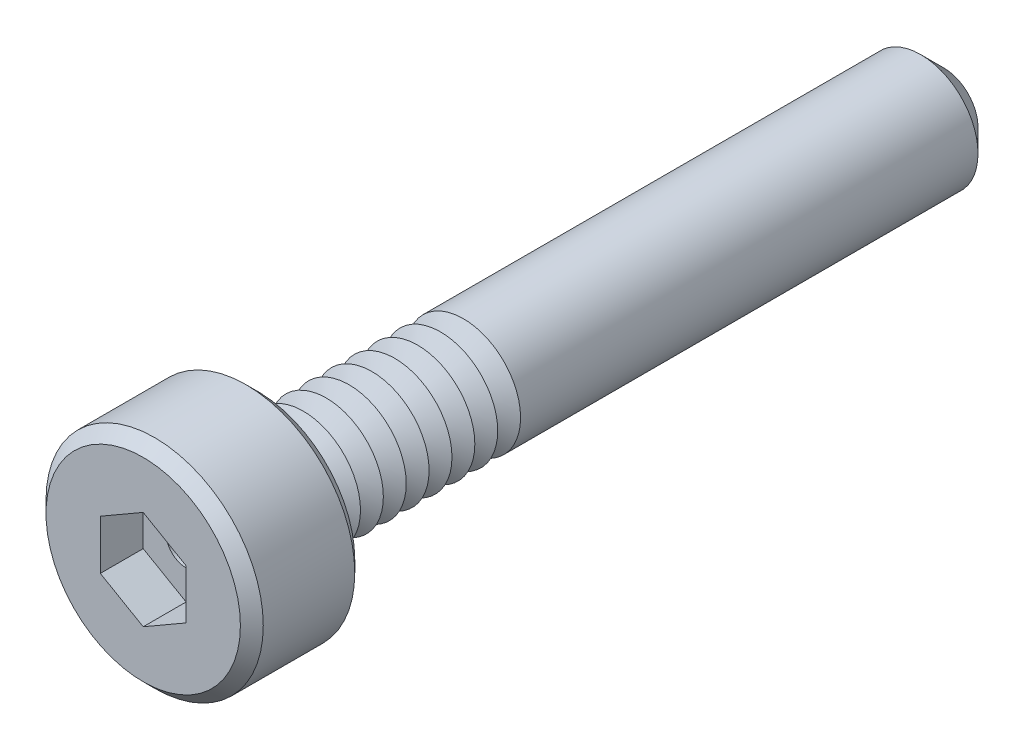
ISO-10303-21;
HEADER;
FILE_DESCRIPTION(('STEP AP214'),'2;1');
FILE_NAME('part.step','',(''),(''),'','','');
FILE_SCHEMA(('AUTOMOTIVE_DESIGN { 1 0 10303 214 1 1 1 1 }'));
ENDSEC;
DATA;
#1=APPLICATION_CONTEXT('core data for automotive mechanical design processes');
#2=APPLICATION_PROTOCOL_DEFINITION('international standard','automotive_design',2000,#1);
#3=PRODUCT_CONTEXT('',#1,'mechanical');
#4=PRODUCT('Part','Part','',(#3));
#5=PRODUCT_RELATED_PRODUCT_CATEGORY('part','',(#4));
#6=PRODUCT_DEFINITION_FORMATION('','',#4);
#7=PRODUCT_DEFINITION_CONTEXT('part definition',#1,'design');
#8=PRODUCT_DEFINITION('design','',#6,#7);
#9=PRODUCT_DEFINITION_SHAPE('','',#8);
#10=(LENGTH_UNIT() NAMED_UNIT(*) SI_UNIT(.MILLI.,.METRE.));
#11=(NAMED_UNIT(*) PLANE_ANGLE_UNIT() SI_UNIT($,.RADIAN.));
#12=(NAMED_UNIT(*) SI_UNIT($,.STERADIAN.) SOLID_ANGLE_UNIT());
#13=UNCERTAINTY_MEASURE_WITH_UNIT(LENGTH_MEASURE(1.E-05),#10,'distance_accuracy_value','');
#14=(GEOMETRIC_REPRESENTATION_CONTEXT(3) GLOBAL_UNCERTAINTY_ASSIGNED_CONTEXT((#13)) GLOBAL_UNIT_ASSIGNED_CONTEXT((#10,
#11,#12)) REPRESENTATION_CONTEXT('',''));
#15=CARTESIAN_POINT('',(0.,0.,0.));
#16=DIRECTION('',(0.,0.,1.));
#17=DIRECTION('',(1.,0.,0.));
#18=AXIS2_PLACEMENT_3D('',#15,#16,#17);
#19=CARTESIAN_POINT('',(0.,0.,2.));
#20=DIRECTION('',(0.,0.,-1.));
#21=DIRECTION('',(-1.,0.,0.));
#22=AXIS2_PLACEMENT_3D('',#19,#20,#21);
#23=CYLINDRICAL_SURFACE('',#22,1.9);
#24=CARTESIAN_POINT('',(0.,0.,0.199999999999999));
#25=DIRECTION('',(0.,0.,1.));
#26=DIRECTION('',(1.,0.,0.));
#27=AXIS2_PLACEMENT_3D('',#24,#25,#26);
#28=CIRCLE('',#27,1.9);
#29=CARTESIAN_POINT('',(1.9,0.,0.199999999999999));
#30=VERTEX_POINT('',#29);
#31=EDGE_CURVE('E253',#30,#30,#28,.T.);
#32=ORIENTED_EDGE('',*,*,#31,.T.);
#33=EDGE_LOOP('',(#32));
#34=FACE_BOUND('',#33,.T.);
#35=CARTESIAN_POINT('',(0.,0.,1.8));
#36=DIRECTION('',(0.,0.,1.));
#37=DIRECTION('',(1.,0.,0.));
#38=AXIS2_PLACEMENT_3D('',#35,#36,#37);
#39=CIRCLE('',#38,1.9);
#40=CARTESIAN_POINT('',(1.9,0.,1.8));
#41=VERTEX_POINT('',#40);
#42=EDGE_CURVE('E249',#41,#41,#39,.F.);
#43=ORIENTED_EDGE('',*,*,#42,.T.);
#44=EDGE_LOOP('',(#43));
#45=FACE_BOUND('',#44,.T.);
#46=ADVANCED_FACE('F39',(#34,#45),#23,.T.);
#47=CARTESIAN_POINT('',(0.,0.,2.));
#48=DIRECTION('',(0.,0.,1.));
#49=DIRECTION('',(1.,0.,0.));
#50=AXIS2_PLACEMENT_3D('',#47,#48,#49);
#51=PLANE('',#50);
#52=CARTESIAN_POINT('',(0.,0.,2.));
#53=DIRECTION('',(0.,0.,1.));
#54=DIRECTION('',(1.,0.,0.));
#55=AXIS2_PLACEMENT_3D('',#52,#53,#54);
#56=CIRCLE('',#55,1.7);
#57=CARTESIAN_POINT('',(1.7,0.,2.));
#58=VERTEX_POINT('',#57);
#59=EDGE_CURVE('E11',#58,#58,#56,.T.);
#60=ORIENTED_EDGE('',*,*,#59,.T.);
#61=EDGE_LOOP('',(#60));
#62=FACE_BOUND('',#61,.T.);
#63=DIRECTION('',(-0.866025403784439,0.5,0.));
#64=VECTOR('',#63,1.);
#65=CARTESIAN_POINT('',(0.749999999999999,0.433012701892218,2.));
#66=LINE('',#65,#64);
#67=CARTESIAN_POINT('',(0.749999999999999,0.433012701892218,2.));
#68=VERTEX_POINT('',#67);
#69=CARTESIAN_POINT('',(0.,0.866025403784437,2.));
#70=VERTEX_POINT('',#69);
#71=EDGE_CURVE('E55',#68,#70,#66,.T.);
#72=ORIENTED_EDGE('',*,*,#71,.F.);
#73=DIRECTION('',(0.,1.,0.));
#74=VECTOR('',#73,1.);
#75=CARTESIAN_POINT('',(0.75,-0.433012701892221,2.));
#76=LINE('',#75,#74);
#77=CARTESIAN_POINT('',(0.75,-0.433012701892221,2.));
#78=VERTEX_POINT('',#77);
#79=EDGE_CURVE('E151',#78,#68,#76,.T.);
#80=ORIENTED_EDGE('',*,*,#79,.F.);
#81=DIRECTION('',(0.866025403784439,0.5,0.));
#82=VECTOR('',#81,1.);
#83=CARTESIAN_POINT('',(0.,-0.86602540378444,2.));
#84=LINE('',#83,#82);
#85=CARTESIAN_POINT('',(0.,-0.86602540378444,2.));
#86=VERTEX_POINT('',#85);
#87=EDGE_CURVE('E148',#86,#78,#84,.T.);
#88=ORIENTED_EDGE('',*,*,#87,.F.);
#89=DIRECTION('',(0.866025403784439,-0.5,0.));
#90=VECTOR('',#89,1.);
#91=CARTESIAN_POINT('',(-0.75,-0.433012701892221,2.));
#92=LINE('',#91,#90);
#93=CARTESIAN_POINT('',(-0.75,-0.433012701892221,2.));
#94=VERTEX_POINT('',#93);
#95=EDGE_CURVE('E103',#94,#86,#92,.T.);
#96=ORIENTED_EDGE('',*,*,#95,.F.);
#97=DIRECTION('',(0.,-1.,0.));
#98=VECTOR('',#97,1.);
#99=CARTESIAN_POINT('',(-0.75,0.433012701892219,2.));
#100=LINE('',#99,#98);
#101=CARTESIAN_POINT('',(-0.75,0.433012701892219,2.));
#102=VERTEX_POINT('',#101);
#103=EDGE_CURVE('E142',#102,#94,#100,.T.);
#104=ORIENTED_EDGE('',*,*,#103,.F.);
#105=DIRECTION('',(-0.866025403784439,-0.499999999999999,0.));
#106=VECTOR('',#105,1.);
#107=CARTESIAN_POINT('',(0.,0.866025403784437,2.));
#108=LINE('',#107,#106);
#109=EDGE_CURVE('E137',#70,#102,#108,.T.);
#110=ORIENTED_EDGE('',*,*,#109,.F.);
#111=EDGE_LOOP('',(#72,#80,#88,#96,#104,#110));
#112=FACE_BOUND('',#111,.T.);
#113=ADVANCED_FACE('F271',(#62,#112),#51,.T.);
#114=CARTESIAN_POINT('',(0.,0.,0.));
#115=DIRECTION('',(0.,0.,1.));
#116=DIRECTION('',(1.,0.,0.));
#117=AXIS2_PLACEMENT_3D('',#114,#115,#116);
#118=PLANE('',#117);
#119=CARTESIAN_POINT('',(0.,0.,0.));
#120=DIRECTION('',(0.,0.,1.));
#121=DIRECTION('',(1.,0.,0.));
#122=AXIS2_PLACEMENT_3D('',#119,#120,#121);
#123=CIRCLE('',#122,1.7);
#124=CARTESIAN_POINT('',(1.7,0.,0.));
#125=VERTEX_POINT('',#124);
#126=EDGE_CURVE('E48',#125,#125,#123,.F.);
#127=ORIENTED_EDGE('',*,*,#126,.T.);
#128=EDGE_LOOP('',(#127));
#129=FACE_BOUND('',#128,.T.);
#130=CARTESIAN_POINT('',(0.,0.,0.));
#131=DIRECTION('',(0.,0.,1.));
#132=DIRECTION('',(1.,0.,0.));
#133=AXIS2_PLACEMENT_3D('',#130,#131,#132);
#134=CIRCLE('',#133,1.);
#135=CARTESIAN_POINT('',(1.,0.,0.));
#136=VERTEX_POINT('',#135);
#137=EDGE_CURVE('E237',#136,#136,#134,.T.);
#138=ORIENTED_EDGE('',*,*,#137,.T.);
#139=EDGE_LOOP('',(#138));
#140=FACE_BOUND('',#139,.T.);
#141=ADVANCED_FACE('F260',(#129,#140),#118,.F.);
#142=CARTESIAN_POINT('',(0.,0.,0.));
#143=DIRECTION('',(0.,0.,1.));
#144=DIRECTION('',(1.,0.,0.));
#145=AXIS2_PLACEMENT_3D('',#142,#143,#144);
#146=CONICAL_SURFACE('',#145,1.,1.0471975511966);
#147=CARTESIAN_POINT('',(0.,0.,-0.200000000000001));
#148=DIRECTION('',(0.,0.,1.));
#149=DIRECTION('',(1.,0.,0.));
#150=AXIS2_PLACEMENT_3D('',#147,#148,#149);
#151=CIRCLE('',#150,0.653589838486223);
#152=CARTESIAN_POINT('',(0.653589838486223,0.,-0.200000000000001));
#153=VERTEX_POINT('',#152);
#154=EDGE_CURVE('E233',#153,#153,#151,.T.);
#155=ORIENTED_EDGE('',*,*,#154,.T.);
#156=EDGE_LOOP('',(#155));
#157=FACE_BOUND('',#156,.T.);
#158=ORIENTED_EDGE('',*,*,#137,.F.);
#159=EDGE_LOOP('',(#158));
#160=FACE_BOUND('',#159,.T.);
#161=ADVANCED_FACE('F392',(#157,#160),#146,.T.);
#162=CARTESIAN_POINT('',(0.,0.,-0.200000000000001));
#163=DIRECTION('',(0.,0.,-1.));
#164=DIRECTION('',(-1.,0.,0.));
#165=AXIS2_PLACEMENT_3D('',#162,#163,#164);
#166=CONICAL_SURFACE('',#165,0.653589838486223,1.0471975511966);
#167=CARTESIAN_POINT('',(0.,0.,-0.4));
#168=DIRECTION('',(0.,0.,1.));
#169=DIRECTION('',(1.,0.,0.));
#170=AXIS2_PLACEMENT_3D('',#167,#168,#169);
#171=CIRCLE('',#170,1.);
#172=CARTESIAN_POINT('',(1.,0.,-0.4));
#173=VERTEX_POINT('',#172);
#174=EDGE_CURVE('E229',#173,#173,#171,.T.);
#175=ORIENTED_EDGE('',*,*,#174,.T.);
#176=EDGE_LOOP('',(#175));
#177=FACE_BOUND('',#176,.T.);
#178=ORIENTED_EDGE('',*,*,#154,.F.);
#179=EDGE_LOOP('',(#178));
#180=FACE_BOUND('',#179,.T.);
#181=ADVANCED_FACE('F388',(#177,#180),#166,.T.);
#182=CARTESIAN_POINT('',(0.,0.,-0.4));
#183=DIRECTION('',(0.,0.,1.));
#184=DIRECTION('',(1.,0.,0.));
#185=AXIS2_PLACEMENT_3D('',#182,#183,#184);
#186=CONICAL_SURFACE('',#185,1.,1.0471975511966);
#187=CARTESIAN_POINT('',(0.,0.,-0.600000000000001));
#188=DIRECTION('',(0.,0.,1.));
#189=DIRECTION('',(1.,0.,0.));
#190=AXIS2_PLACEMENT_3D('',#187,#188,#189);
#191=CIRCLE('',#190,0.653589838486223);
#192=CARTESIAN_POINT('',(0.653589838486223,0.,-0.600000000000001));
#193=VERTEX_POINT('',#192);
#194=EDGE_CURVE('E225',#193,#193,#191,.T.);
#195=ORIENTED_EDGE('',*,*,#194,.T.);
#196=EDGE_LOOP('',(#195));
#197=FACE_BOUND('',#196,.T.);
#198=ORIENTED_EDGE('',*,*,#174,.F.);
#199=EDGE_LOOP('',(#198));
#200=FACE_BOUND('',#199,.T.);
#201=ADVANCED_FACE('F384',(#197,#200),#186,.T.);
#202=CARTESIAN_POINT('',(0.,0.,-0.600000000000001));
#203=DIRECTION('',(0.,0.,-1.));
#204=DIRECTION('',(-1.,0.,0.));
#205=AXIS2_PLACEMENT_3D('',#202,#203,#204);
#206=CONICAL_SURFACE('',#205,0.653589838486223,1.0471975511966);
#207=CARTESIAN_POINT('',(0.,0.,-0.8));
#208=DIRECTION('',(0.,0.,1.));
#209=DIRECTION('',(1.,0.,0.));
#210=AXIS2_PLACEMENT_3D('',#207,#208,#209);
#211=CIRCLE('',#210,1.);
#212=CARTESIAN_POINT('',(1.,0.,-0.8));
#213=VERTEX_POINT('',#212);
#214=EDGE_CURVE('E221',#213,#213,#211,.T.);
#215=ORIENTED_EDGE('',*,*,#214,.T.);
#216=EDGE_LOOP('',(#215));
#217=FACE_BOUND('',#216,.T.);
#218=ORIENTED_EDGE('',*,*,#194,.F.);
#219=EDGE_LOOP('',(#218));
#220=FACE_BOUND('',#219,.T.);
#221=ADVANCED_FACE('F380',(#217,#220),#206,.T.);
#222=CARTESIAN_POINT('',(0.,0.,-0.8));
#223=DIRECTION('',(0.,0.,1.));
#224=DIRECTION('',(1.,0.,0.));
#225=AXIS2_PLACEMENT_3D('',#222,#223,#224);
#226=CONICAL_SURFACE('',#225,1.,1.0471975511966);
#227=CARTESIAN_POINT('',(0.,0.,-1.));
#228=DIRECTION('',(0.,0.,1.));
#229=DIRECTION('',(1.,0.,0.));
#230=AXIS2_PLACEMENT_3D('',#227,#228,#229);
#231=CIRCLE('',#230,0.653589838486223);
#232=CARTESIAN_POINT('',(0.653589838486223,0.,-1.));
#233=VERTEX_POINT('',#232);
#234=EDGE_CURVE('E217',#233,#233,#231,.T.);
#235=ORIENTED_EDGE('',*,*,#234,.T.);
#236=EDGE_LOOP('',(#235));
#237=FACE_BOUND('',#236,.T.);
#238=ORIENTED_EDGE('',*,*,#214,.F.);
#239=EDGE_LOOP('',(#238));
#240=FACE_BOUND('',#239,.T.);
#241=ADVANCED_FACE('F376',(#237,#240),#226,.T.);
#242=CARTESIAN_POINT('',(0.,0.,-1.));
#243=DIRECTION('',(0.,0.,-1.));
#244=DIRECTION('',(-1.,0.,0.));
#245=AXIS2_PLACEMENT_3D('',#242,#243,#244);
#246=CONICAL_SURFACE('',#245,0.653589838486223,1.0471975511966);
#247=CARTESIAN_POINT('',(0.,0.,-1.2));
#248=DIRECTION('',(0.,0.,1.));
#249=DIRECTION('',(1.,0.,0.));
#250=AXIS2_PLACEMENT_3D('',#247,#248,#249);
#251=CIRCLE('',#250,1.);
#252=CARTESIAN_POINT('',(1.,0.,-1.2));
#253=VERTEX_POINT('',#252);
#254=EDGE_CURVE('E213',#253,#253,#251,.T.);
#255=ORIENTED_EDGE('',*,*,#254,.T.);
#256=EDGE_LOOP('',(#255));
#257=FACE_BOUND('',#256,.T.);
#258=ORIENTED_EDGE('',*,*,#234,.F.);
#259=EDGE_LOOP('',(#258));
#260=FACE_BOUND('',#259,.T.);
#261=ADVANCED_FACE('F372',(#257,#260),#246,.T.);
#262=CARTESIAN_POINT('',(0.,0.,-1.2));
#263=DIRECTION('',(0.,0.,1.));
#264=DIRECTION('',(1.,0.,0.));
#265=AXIS2_PLACEMENT_3D('',#262,#263,#264);
#266=CONICAL_SURFACE('',#265,1.,1.0471975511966);
#267=CARTESIAN_POINT('',(0.,0.,-1.4));
#268=DIRECTION('',(0.,0.,1.));
#269=DIRECTION('',(1.,0.,0.));
#270=AXIS2_PLACEMENT_3D('',#267,#268,#269);
#271=CIRCLE('',#270,0.653589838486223);
#272=CARTESIAN_POINT('',(0.653589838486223,0.,-1.4));
#273=VERTEX_POINT('',#272);
#274=EDGE_CURVE('E209',#273,#273,#271,.T.);
#275=ORIENTED_EDGE('',*,*,#274,.T.);
#276=EDGE_LOOP('',(#275));
#277=FACE_BOUND('',#276,.T.);
#278=ORIENTED_EDGE('',*,*,#254,.F.);
#279=EDGE_LOOP('',(#278));
#280=FACE_BOUND('',#279,.T.);
#281=ADVANCED_FACE('F368',(#277,#280),#266,.T.);
#282=CARTESIAN_POINT('',(0.,0.,-1.4));
#283=DIRECTION('',(0.,0.,-1.));
#284=DIRECTION('',(-1.,0.,0.));
#285=AXIS2_PLACEMENT_3D('',#282,#283,#284);
#286=CONICAL_SURFACE('',#285,0.653589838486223,1.0471975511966);
#287=CARTESIAN_POINT('',(0.,0.,-1.6));
#288=DIRECTION('',(0.,0.,1.));
#289=DIRECTION('',(1.,0.,0.));
#290=AXIS2_PLACEMENT_3D('',#287,#288,#289);
#291=CIRCLE('',#290,1.);
#292=CARTESIAN_POINT('',(1.,0.,-1.6));
#293=VERTEX_POINT('',#292);
#294=EDGE_CURVE('E205',#293,#293,#291,.T.);
#295=ORIENTED_EDGE('',*,*,#294,.T.);
#296=EDGE_LOOP('',(#295));
#297=FACE_BOUND('',#296,.T.);
#298=ORIENTED_EDGE('',*,*,#274,.F.);
#299=EDGE_LOOP('',(#298));
#300=FACE_BOUND('',#299,.T.);
#301=ADVANCED_FACE('F364',(#297,#300),#286,.T.);
#302=CARTESIAN_POINT('',(0.,0.,-1.6));
#303=DIRECTION('',(0.,0.,1.));
#304=DIRECTION('',(1.,0.,0.));
#305=AXIS2_PLACEMENT_3D('',#302,#303,#304);
#306=CONICAL_SURFACE('',#305,1.,1.0471975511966);
#307=CARTESIAN_POINT('',(0.,0.,-1.8));
#308=DIRECTION('',(0.,0.,1.));
#309=DIRECTION('',(1.,0.,0.));
#310=AXIS2_PLACEMENT_3D('',#307,#308,#309);
#311=CIRCLE('',#310,0.653589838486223);
#312=CARTESIAN_POINT('',(0.653589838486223,0.,-1.8));
#313=VERTEX_POINT('',#312);
#314=EDGE_CURVE('E201',#313,#313,#311,.T.);
#315=ORIENTED_EDGE('',*,*,#314,.T.);
#316=EDGE_LOOP('',(#315));
#317=FACE_BOUND('',#316,.T.);
#318=ORIENTED_EDGE('',*,*,#294,.F.);
#319=EDGE_LOOP('',(#318));
#320=FACE_BOUND('',#319,.T.);
#321=ADVANCED_FACE('F360',(#317,#320),#306,.T.);
#322=CARTESIAN_POINT('',(0.,0.,-1.8));
#323=DIRECTION('',(0.,0.,-1.));
#324=DIRECTION('',(-1.,0.,0.));
#325=AXIS2_PLACEMENT_3D('',#322,#323,#324);
#326=CONICAL_SURFACE('',#325,0.653589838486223,1.0471975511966);
#327=CARTESIAN_POINT('',(0.,0.,-2.));
#328=DIRECTION('',(0.,0.,1.));
#329=DIRECTION('',(1.,0.,0.));
#330=AXIS2_PLACEMENT_3D('',#327,#328,#329);
#331=CIRCLE('',#330,1.);
#332=CARTESIAN_POINT('',(1.,0.,-2.));
#333=VERTEX_POINT('',#332);
#334=EDGE_CURVE('E197',#333,#333,#331,.T.);
#335=ORIENTED_EDGE('',*,*,#334,.T.);
#336=EDGE_LOOP('',(#335));
#337=FACE_BOUND('',#336,.T.);
#338=ORIENTED_EDGE('',*,*,#314,.F.);
#339=EDGE_LOOP('',(#338));
#340=FACE_BOUND('',#339,.T.);
#341=ADVANCED_FACE('F356',(#337,#340),#326,.T.);
#342=CARTESIAN_POINT('',(0.,0.,-2.));
#343=DIRECTION('',(0.,0.,1.));
#344=DIRECTION('',(1.,0.,0.));
#345=AXIS2_PLACEMENT_3D('',#342,#343,#344);
#346=CONICAL_SURFACE('',#345,1.,1.0471975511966);
#347=CARTESIAN_POINT('',(0.,0.,-2.2));
#348=DIRECTION('',(0.,0.,1.));
#349=DIRECTION('',(1.,0.,0.));
#350=AXIS2_PLACEMENT_3D('',#347,#348,#349);
#351=CIRCLE('',#350,0.653589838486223);
#352=CARTESIAN_POINT('',(0.653589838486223,0.,-2.2));
#353=VERTEX_POINT('',#352);
#354=EDGE_CURVE('E193',#353,#353,#351,.T.);
#355=ORIENTED_EDGE('',*,*,#354,.T.);
#356=EDGE_LOOP('',(#355));
#357=FACE_BOUND('',#356,.T.);
#358=ORIENTED_EDGE('',*,*,#334,.F.);
#359=EDGE_LOOP('',(#358));
#360=FACE_BOUND('',#359,.T.);
#361=ADVANCED_FACE('F352',(#357,#360),#346,.T.);
#362=CARTESIAN_POINT('',(0.,0.,-2.2));
#363=DIRECTION('',(0.,0.,-1.));
#364=DIRECTION('',(-1.,0.,0.));
#365=AXIS2_PLACEMENT_3D('',#362,#363,#364);
#366=CONICAL_SURFACE('',#365,0.653589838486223,1.0471975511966);
#367=CARTESIAN_POINT('',(0.,0.,-2.4));
#368=DIRECTION('',(0.,0.,1.));
#369=DIRECTION('',(1.,0.,0.));
#370=AXIS2_PLACEMENT_3D('',#367,#368,#369);
#371=CIRCLE('',#370,1.);
#372=CARTESIAN_POINT('',(1.,0.,-2.4));
#373=VERTEX_POINT('',#372);
#374=EDGE_CURVE('E189',#373,#373,#371,.T.);
#375=ORIENTED_EDGE('',*,*,#374,.T.);
#376=EDGE_LOOP('',(#375));
#377=FACE_BOUND('',#376,.T.);
#378=ORIENTED_EDGE('',*,*,#354,.F.);
#379=EDGE_LOOP('',(#378));
#380=FACE_BOUND('',#379,.T.);
#381=ADVANCED_FACE('F348',(#377,#380),#366,.T.);
#382=CARTESIAN_POINT('',(0.,0.,-2.4));
#383=DIRECTION('',(0.,0.,1.));
#384=DIRECTION('',(1.,0.,0.));
#385=AXIS2_PLACEMENT_3D('',#382,#383,#384);
#386=CONICAL_SURFACE('',#385,1.,1.0471975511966);
#387=CARTESIAN_POINT('',(0.,0.,-2.6));
#388=DIRECTION('',(0.,0.,1.));
#389=DIRECTION('',(1.,0.,0.));
#390=AXIS2_PLACEMENT_3D('',#387,#388,#389);
#391=CIRCLE('',#390,0.653589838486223);
#392=CARTESIAN_POINT('',(0.653589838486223,0.,-2.6));
#393=VERTEX_POINT('',#392);
#394=EDGE_CURVE('E185',#393,#393,#391,.T.);
#395=ORIENTED_EDGE('',*,*,#394,.T.);
#396=EDGE_LOOP('',(#395));
#397=FACE_BOUND('',#396,.T.);
#398=ORIENTED_EDGE('',*,*,#374,.F.);
#399=EDGE_LOOP('',(#398));
#400=FACE_BOUND('',#399,.T.);
#401=ADVANCED_FACE('F344',(#397,#400),#386,.T.);
#402=CARTESIAN_POINT('',(0.,0.,-2.6));
#403=DIRECTION('',(0.,0.,-1.));
#404=DIRECTION('',(-1.,0.,0.));
#405=AXIS2_PLACEMENT_3D('',#402,#403,#404);
#406=CONICAL_SURFACE('',#405,0.653589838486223,1.0471975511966);
#407=CARTESIAN_POINT('',(0.,0.,-2.8));
#408=DIRECTION('',(0.,0.,1.));
#409=DIRECTION('',(1.,0.,0.));
#410=AXIS2_PLACEMENT_3D('',#407,#408,#409);
#411=CIRCLE('',#410,1.);
#412=CARTESIAN_POINT('',(1.,0.,-2.8));
#413=VERTEX_POINT('',#412);
#414=EDGE_CURVE('E181',#413,#413,#411,.T.);
#415=ORIENTED_EDGE('',*,*,#414,.T.);
#416=EDGE_LOOP('',(#415));
#417=FACE_BOUND('',#416,.T.);
#418=ORIENTED_EDGE('',*,*,#394,.F.);
#419=EDGE_LOOP('',(#418));
#420=FACE_BOUND('',#419,.T.);
#421=ADVANCED_FACE('F340',(#417,#420),#406,.T.);
#422=CARTESIAN_POINT('',(0.,0.,-2.8));
#423=DIRECTION('',(0.,0.,1.));
#424=DIRECTION('',(1.,0.,0.));
#425=AXIS2_PLACEMENT_3D('',#422,#423,#424);
#426=CONICAL_SURFACE('',#425,1.,1.0471975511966);
#427=CARTESIAN_POINT('',(0.,0.,-3.));
#428=DIRECTION('',(0.,0.,1.));
#429=DIRECTION('',(1.,0.,0.));
#430=AXIS2_PLACEMENT_3D('',#427,#428,#429);
#431=CIRCLE('',#430,0.653589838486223);
#432=CARTESIAN_POINT('',(0.653589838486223,0.,-3.));
#433=VERTEX_POINT('',#432);
#434=EDGE_CURVE('E177',#433,#433,#431,.T.);
#435=ORIENTED_EDGE('',*,*,#434,.T.);
#436=EDGE_LOOP('',(#435));
#437=FACE_BOUND('',#436,.T.);
#438=ORIENTED_EDGE('',*,*,#414,.F.);
#439=EDGE_LOOP('',(#438));
#440=FACE_BOUND('',#439,.T.);
#441=ADVANCED_FACE('F336',(#437,#440),#426,.T.);
#442=CARTESIAN_POINT('',(0.,0.,-3.));
#443=DIRECTION('',(0.,0.,-1.));
#444=DIRECTION('',(-1.,0.,0.));
#445=AXIS2_PLACEMENT_3D('',#442,#443,#444);
#446=CONICAL_SURFACE('',#445,0.653589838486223,1.0471975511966);
#447=CARTESIAN_POINT('',(0.,0.,-3.2));
#448=DIRECTION('',(0.,0.,1.));
#449=DIRECTION('',(1.,0.,0.));
#450=AXIS2_PLACEMENT_3D('',#447,#448,#449);
#451=CIRCLE('',#450,1.);
#452=CARTESIAN_POINT('',(1.,0.,-3.2));
#453=VERTEX_POINT('',#452);
#454=EDGE_CURVE('E173',#453,#453,#451,.T.);
#455=ORIENTED_EDGE('',*,*,#454,.T.);
#456=EDGE_LOOP('',(#455));
#457=FACE_BOUND('',#456,.T.);
#458=ORIENTED_EDGE('',*,*,#434,.F.);
#459=EDGE_LOOP('',(#458));
#460=FACE_BOUND('',#459,.T.);
#461=ADVANCED_FACE('F332',(#457,#460),#446,.T.);
#462=CARTESIAN_POINT('',(0.,0.,-3.2));
#463=DIRECTION('',(0.,0.,1.));
#464=DIRECTION('',(1.,0.,0.));
#465=AXIS2_PLACEMENT_3D('',#462,#463,#464);
#466=CONICAL_SURFACE('',#465,1.,1.0471975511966);
#467=CARTESIAN_POINT('',(0.,0.,-3.4));
#468=DIRECTION('',(0.,0.,1.));
#469=DIRECTION('',(1.,0.,0.));
#470=AXIS2_PLACEMENT_3D('',#467,#468,#469);
#471=CIRCLE('',#470,0.653589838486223);
#472=CARTESIAN_POINT('',(0.653589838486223,0.,-3.4));
#473=VERTEX_POINT('',#472);
#474=EDGE_CURVE('E169',#473,#473,#471,.T.);
#475=ORIENTED_EDGE('',*,*,#474,.T.);
#476=EDGE_LOOP('',(#475));
#477=FACE_BOUND('',#476,.T.);
#478=ORIENTED_EDGE('',*,*,#454,.F.);
#479=EDGE_LOOP('',(#478));
#480=FACE_BOUND('',#479,.T.);
#481=ADVANCED_FACE('F328',(#477,#480),#466,.T.);
#482=CARTESIAN_POINT('',(0.,0.,-3.4));
#483=DIRECTION('',(0.,0.,-1.));
#484=DIRECTION('',(-1.,0.,0.));
#485=AXIS2_PLACEMENT_3D('',#482,#483,#484);
#486=CONICAL_SURFACE('',#485,0.653589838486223,1.0471975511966);
#487=CARTESIAN_POINT('',(0.,0.,-3.6));
#488=DIRECTION('',(0.,0.,1.));
#489=DIRECTION('',(1.,0.,0.));
#490=AXIS2_PLACEMENT_3D('',#487,#488,#489);
#491=CIRCLE('',#490,1.);
#492=CARTESIAN_POINT('',(1.,0.,-3.6));
#493=VERTEX_POINT('',#492);
#494=EDGE_CURVE('E157',#493,#493,#491,.T.);
#495=ORIENTED_EDGE('',*,*,#494,.T.);
#496=EDGE_LOOP('',(#495));
#497=FACE_BOUND('',#496,.T.);
#498=ORIENTED_EDGE('',*,*,#474,.F.);
#499=EDGE_LOOP('',(#498));
#500=FACE_BOUND('',#499,.T.);
#501=ADVANCED_FACE('F324',(#497,#500),#486,.T.);
#502=CARTESIAN_POINT('',(0.,0.,-12.));
#503=DIRECTION('',(0.,0.,-1.));
#504=DIRECTION('',(-1.,0.,0.));
#505=AXIS2_PLACEMENT_3D('',#502,#503,#504);
#506=PLANE('',#505);
#507=CARTESIAN_POINT('',(0.,0.,-12.));
#508=DIRECTION('',(0.,0.,-1.));
#509=DIRECTION('',(-1.,0.,0.));
#510=AXIS2_PLACEMENT_3D('',#507,#508,#509);
#511=CIRCLE('',#510,0.35);
#512=CARTESIAN_POINT('',(-0.35,0.,-12.));
#513=VERTEX_POINT('',#512);
#514=EDGE_CURVE('E138',#513,#513,#511,.F.);
#515=ORIENTED_EDGE('',*,*,#514,.T.);
#516=EDGE_LOOP('',(#515));
#517=FACE_BOUND('',#516,.T.);
#518=CARTESIAN_POINT('',(0.,0.,-12.));
#519=DIRECTION('',(0.,0.,-1.));
#520=DIRECTION('',(-1.,0.,0.));
#521=AXIS2_PLACEMENT_3D('',#518,#519,#520);
#522=CIRCLE('',#521,0.600000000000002);
#523=CARTESIAN_POINT('',(-0.600000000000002,0.,-12.));
#524=VERTEX_POINT('',#523);
#525=EDGE_CURVE('E241',#524,#524,#522,.T.);
#526=ORIENTED_EDGE('',*,*,#525,.T.);
#527=EDGE_LOOP('',(#526));
#528=FACE_BOUND('',#527,.T.);
#529=ADVANCED_FACE('F327',(#517,#528),#506,.T.);
#530=CARTESIAN_POINT('',(0.,0.,-12.));
#531=DIRECTION('',(0.,0.,1.));
#532=DIRECTION('',(1.,0.,0.));
#533=AXIS2_PLACEMENT_3D('',#530,#531,#532);
#534=CONICAL_SURFACE('',#533,0.600000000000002,0.785398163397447);
#535=CARTESIAN_POINT('',(0.,0.,-11.6));
#536=DIRECTION('',(0.,0.,-1.));
#537=DIRECTION('',(-1.,0.,0.));
#538=AXIS2_PLACEMENT_3D('',#535,#536,#537);
#539=CIRCLE('',#538,1.);
#540=CARTESIAN_POINT('',(-1.,0.,-11.6));
#541=VERTEX_POINT('',#540);
#542=EDGE_CURVE('E245',#541,#541,#539,.F.);
#543=ORIENTED_EDGE('',*,*,#542,.F.);
#544=EDGE_LOOP('',(#543));
#545=FACE_BOUND('',#544,.T.);
#546=ORIENTED_EDGE('',*,*,#525,.F.);
#547=EDGE_LOOP('',(#546));
#548=FACE_BOUND('',#547,.T.);
#549=ADVANCED_FACE('F399',(#545,#548),#534,.T.);
#550=CARTESIAN_POINT('',(0.,0.,-12.));
#551=DIRECTION('',(0.,0.,1.));
#552=DIRECTION('',(1.,0.,0.));
#553=AXIS2_PLACEMENT_3D('',#550,#551,#552);
#554=CYLINDRICAL_SURFACE('',#553,1.);
#555=ORIENTED_EDGE('',*,*,#542,.T.);
#556=EDGE_LOOP('',(#555));
#557=FACE_BOUND('',#556,.T.);
#558=ORIENTED_EDGE('',*,*,#494,.F.);
#559=EDGE_LOOP('',(#558));
#560=FACE_BOUND('',#559,.T.);
#561=ADVANCED_FACE('F323',(#557,#560),#554,.T.);
#562=CARTESIAN_POINT('',(0.749999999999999,0.433012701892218,1.25));
#563=DIRECTION('',(0.5,0.866025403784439,0.));
#564=DIRECTION('',(-0.866025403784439,0.5,0.));
#565=AXIS2_PLACEMENT_3D('',#562,#563,#564);
#566=PLANE('',#565);
#567=ORIENTED_EDGE('',*,*,#71,.T.);
#568=DIRECTION('',(0.,0.,1.));
#569=VECTOR('',#568,1.);
#570=CARTESIAN_POINT('',(0.,0.866025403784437,1.25));
#571=LINE('',#570,#569);
#572=CARTESIAN_POINT('',(0.,0.866025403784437,1.25));
#573=VERTEX_POINT('',#572);
#574=EDGE_CURVE('E85',#573,#70,#571,.T.);
#575=ORIENTED_EDGE('',*,*,#574,.F.);
#576=DIRECTION('',(-0.866025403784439,0.5,0.));
#577=VECTOR('',#576,1.);
#578=CARTESIAN_POINT('',(0.749999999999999,0.433012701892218,1.25));
#579=LINE('',#578,#577);
#580=CARTESIAN_POINT('',(0.749999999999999,0.433012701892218,1.25));
#581=VERTEX_POINT('',#580);
#582=EDGE_CURVE('E154',#581,#573,#579,.T.);
#583=ORIENTED_EDGE('',*,*,#582,.F.);
#584=DIRECTION('',(0.,0.,1.));
#585=VECTOR('',#584,1.);
#586=CARTESIAN_POINT('',(0.749999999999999,0.433012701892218,1.25));
#587=LINE('',#586,#585);
#588=EDGE_CURVE('E63',#581,#68,#587,.T.);
#589=ORIENTED_EDGE('',*,*,#588,.T.);
#590=EDGE_LOOP('',(#567,#575,#583,#589));
#591=FACE_BOUND('',#590,.T.);
#592=ADVANCED_FACE('F313',(#591),#566,.F.);
#593=CARTESIAN_POINT('',(0.75,-0.433012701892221,1.25));
#594=DIRECTION('',(1.,0.,0.));
#595=DIRECTION('',(0.,1.,0.));
#596=AXIS2_PLACEMENT_3D('',#593,#594,#595);
#597=PLANE('',#596);
#598=ORIENTED_EDGE('',*,*,#79,.T.);
#599=ORIENTED_EDGE('',*,*,#588,.F.);
#600=DIRECTION('',(0.,1.,0.));
#601=VECTOR('',#600,1.);
#602=CARTESIAN_POINT('',(0.75,-0.433012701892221,1.25));
#603=LINE('',#602,#601);
#604=CARTESIAN_POINT('',(0.75,-0.433012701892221,1.25));
#605=VERTEX_POINT('',#604);
#606=EDGE_CURVE('E117',#605,#581,#603,.T.);
#607=ORIENTED_EDGE('',*,*,#606,.F.);
#608=DIRECTION('',(0.,0.,1.));
#609=VECTOR('',#608,1.);
#610=CARTESIAN_POINT('',(0.75,-0.433012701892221,1.25));
#611=LINE('',#610,#609);
#612=EDGE_CURVE('E108',#605,#78,#611,.T.);
#613=ORIENTED_EDGE('',*,*,#612,.T.);
#614=EDGE_LOOP('',(#598,#599,#607,#613));
#615=FACE_BOUND('',#614,.T.);
#616=ADVANCED_FACE('F310',(#615),#597,.F.);
#617=CARTESIAN_POINT('',(0.,-0.86602540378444,1.25));
#618=DIRECTION('',(0.5,-0.866025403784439,0.));
#619=DIRECTION('',(0.866025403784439,0.5,0.));
#620=AXIS2_PLACEMENT_3D('',#617,#618,#619);
#621=PLANE('',#620);
#622=ORIENTED_EDGE('',*,*,#87,.T.);
#623=ORIENTED_EDGE('',*,*,#612,.F.);
#624=DIRECTION('',(0.866025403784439,0.5,0.));
#625=VECTOR('',#624,1.);
#626=CARTESIAN_POINT('',(0.,-0.86602540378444,1.25));
#627=LINE('',#626,#625);
#628=CARTESIAN_POINT('',(0.,-0.86602540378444,1.25));
#629=VERTEX_POINT('',#628);
#630=EDGE_CURVE('E112',#629,#605,#627,.T.);
#631=ORIENTED_EDGE('',*,*,#630,.F.);
#632=DIRECTION('',(0.,0.,1.));
#633=VECTOR('',#632,1.);
#634=CARTESIAN_POINT('',(0.,-0.86602540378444,1.25));
#635=LINE('',#634,#633);
#636=EDGE_CURVE('E96',#629,#86,#635,.T.);
#637=ORIENTED_EDGE('',*,*,#636,.T.);
#638=EDGE_LOOP('',(#622,#623,#631,#637));
#639=FACE_BOUND('',#638,.T.);
#640=ADVANCED_FACE('F113',(#639),#621,.F.);
#641=CARTESIAN_POINT('',(-0.75,-0.433012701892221,1.25));
#642=DIRECTION('',(-0.5,-0.866025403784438,0.));
#643=DIRECTION('',(0.866025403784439,-0.5,0.));
#644=AXIS2_PLACEMENT_3D('',#641,#642,#643);
#645=PLANE('',#644);
#646=ORIENTED_EDGE('',*,*,#95,.T.);
#647=ORIENTED_EDGE('',*,*,#636,.F.);
#648=DIRECTION('',(0.866025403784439,-0.5,0.));
#649=VECTOR('',#648,1.);
#650=CARTESIAN_POINT('',(-0.75,-0.433012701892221,1.25));
#651=LINE('',#650,#649);
#652=CARTESIAN_POINT('',(-0.75,-0.433012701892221,1.25));
#653=VERTEX_POINT('',#652);
#654=EDGE_CURVE('E100',#653,#629,#651,.T.);
#655=ORIENTED_EDGE('',*,*,#654,.F.);
#656=DIRECTION('',(0.,0.,1.));
#657=VECTOR('',#656,1.);
#658=CARTESIAN_POINT('',(-0.75,-0.433012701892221,1.25));
#659=LINE('',#658,#657);
#660=EDGE_CURVE('E109',#653,#94,#659,.T.);
#661=ORIENTED_EDGE('',*,*,#660,.T.);
#662=EDGE_LOOP('',(#646,#647,#655,#661));
#663=FACE_BOUND('',#662,.T.);
#664=ADVANCED_FACE('F98',(#663),#645,.F.);
#665=CARTESIAN_POINT('',(-0.75,0.433012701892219,1.25));
#666=DIRECTION('',(-1.,0.,0.));
#667=DIRECTION('',(0.,0.,1.));
#668=AXIS2_PLACEMENT_3D('',#665,#666,#667);
#669=PLANE('',#668);
#670=ORIENTED_EDGE('',*,*,#103,.T.);
#671=ORIENTED_EDGE('',*,*,#660,.F.);
#672=DIRECTION('',(0.,-1.,0.));
#673=VECTOR('',#672,1.);
#674=CARTESIAN_POINT('',(-0.75,0.433012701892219,1.25));
#675=LINE('',#674,#673);
#676=CARTESIAN_POINT('',(-0.75,0.433012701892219,1.25));
#677=VERTEX_POINT('',#676);
#678=EDGE_CURVE('E123',#677,#653,#675,.T.);
#679=ORIENTED_EDGE('',*,*,#678,.F.);
#680=DIRECTION('',(0.,0.,1.));
#681=VECTOR('',#680,1.);
#682=CARTESIAN_POINT('',(-0.75,0.433012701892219,1.25));
#683=LINE('',#682,#681);
#684=EDGE_CURVE('E162',#677,#102,#683,.T.);
#685=ORIENTED_EDGE('',*,*,#684,.T.);
#686=EDGE_LOOP('',(#670,#671,#679,#685));
#687=FACE_BOUND('',#686,.T.);
#688=ADVANCED_FACE('F307',(#687),#669,.F.);
#689=CARTESIAN_POINT('',(0.,0.866025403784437,1.25));
#690=DIRECTION('',(-0.499999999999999,0.866025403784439,0.));
#691=DIRECTION('',(-0.866025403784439,-0.499999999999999,0.));
#692=AXIS2_PLACEMENT_3D('',#689,#690,#691);
#693=PLANE('',#692);
#694=ORIENTED_EDGE('',*,*,#109,.T.);
#695=ORIENTED_EDGE('',*,*,#684,.F.);
#696=DIRECTION('',(-0.866025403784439,-0.499999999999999,0.));
#697=VECTOR('',#696,1.);
#698=CARTESIAN_POINT('',(0.,0.866025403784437,1.25));
#699=LINE('',#698,#697);
#700=EDGE_CURVE('E129',#573,#677,#699,.T.);
#701=ORIENTED_EDGE('',*,*,#700,.F.);
#702=ORIENTED_EDGE('',*,*,#574,.T.);
#703=EDGE_LOOP('',(#694,#695,#701,#702));
#704=FACE_BOUND('',#703,.T.);
#705=ADVANCED_FACE('F286',(#704),#693,.F.);
#706=CARTESIAN_POINT('',(0.,0.,1.25));
#707=DIRECTION('',(0.,0.,1.));
#708=DIRECTION('',(1.,0.,0.));
#709=AXIS2_PLACEMENT_3D('',#706,#707,#708);
#710=PLANE('',#709);
#711=CARTESIAN_POINT('',(0.,0.,1.25));
#712=DIRECTION('',(0.,0.,1.));
#713=DIRECTION('',(1.,0.,0.));
#714=AXIS2_PLACEMENT_3D('',#711,#712,#713);
#715=CIRCLE('',#714,0.35);
#716=CARTESIAN_POINT('',(0.35,0.,1.25));
#717=VERTEX_POINT('',#716);
#718=EDGE_CURVE('E293',#717,#717,#715,.T.);
#719=ORIENTED_EDGE('',*,*,#718,.F.);
#720=EDGE_LOOP('',(#719));
#721=FACE_BOUND('',#720,.T.);
#722=ORIENTED_EDGE('',*,*,#582,.T.);
#723=ORIENTED_EDGE('',*,*,#700,.T.);
#724=ORIENTED_EDGE('',*,*,#678,.T.);
#725=ORIENTED_EDGE('',*,*,#654,.T.);
#726=ORIENTED_EDGE('',*,*,#630,.T.);
#727=ORIENTED_EDGE('',*,*,#606,.T.);
#728=EDGE_LOOP('',(#722,#723,#724,#725,#726,#727));
#729=FACE_BOUND('',#728,.T.);
#730=ADVANCED_FACE('F120',(#721,#729),#710,.T.);
#731=CARTESIAN_POINT('',(0.,0.,-12.9899494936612));
#732=DIRECTION('',(0.,0.,1.));
#733=DIRECTION('',(1.,0.,0.));
#734=AXIS2_PLACEMENT_3D('',#731,#732,#733);
#735=CYLINDRICAL_SURFACE('',#734,0.35);
#736=ORIENTED_EDGE('',*,*,#718,.T.);
#737=EDGE_LOOP('',(#736));
#738=FACE_BOUND('',#737,.T.);
#739=ORIENTED_EDGE('',*,*,#514,.F.);
#740=EDGE_LOOP('',(#739));
#741=FACE_BOUND('',#740,.T.);
#742=ADVANCED_FACE('F266',(#738,#741),#735,.F.);
#743=CARTESIAN_POINT('',(0.,0.,0.199999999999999));
#744=DIRECTION('',(0.,0.,1.));
#745=DIRECTION('',(1.,0.,0.));
#746=AXIS2_PLACEMENT_3D('',#743,#744,#745);
#747=CONICAL_SURFACE('',#746,1.9,0.785398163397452);
#748=CARTESIAN_POINT('',(1.7,0.,0.));
#749=CARTESIAN_POINT('',(1.70208333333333,0.,0.00208333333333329));
#750=CARTESIAN_POINT('',(1.70416666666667,0.,0.00416666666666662));
#751=CARTESIAN_POINT('',(1.70833333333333,0.,0.0083333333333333));
#752=CARTESIAN_POINT('',(1.71041666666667,0.,0.0104166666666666));
#753=CARTESIAN_POINT('',(1.71458333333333,0.,0.0145833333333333));
#754=CARTESIAN_POINT('',(1.71666666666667,0.,0.0166666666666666));
#755=CARTESIAN_POINT('',(1.72083333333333,0.,0.0208333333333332));
#756=CARTESIAN_POINT('',(1.72291666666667,0.,0.0229166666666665));
#757=CARTESIAN_POINT('',(1.72708333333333,0.,0.0270833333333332));
#758=CARTESIAN_POINT('',(1.72916666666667,0.,0.0291666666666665));
#759=CARTESIAN_POINT('',(1.73333333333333,0.,0.0333333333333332));
#760=CARTESIAN_POINT('',(1.73541666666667,0.,0.0354166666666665));
#761=CARTESIAN_POINT('',(1.73958333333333,0.,0.0395833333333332));
#762=CARTESIAN_POINT('',(1.74166666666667,0.,0.0416666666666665));
#763=CARTESIAN_POINT('',(1.74583333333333,0.,0.0458333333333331));
#764=CARTESIAN_POINT('',(1.74791666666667,0.,0.0479166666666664));
#765=CARTESIAN_POINT('',(1.75208333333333,0.,0.0520833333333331));
#766=CARTESIAN_POINT('',(1.75416666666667,0.,0.0541666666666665));
#767=CARTESIAN_POINT('',(1.75833333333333,0.,0.0583333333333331));
#768=CARTESIAN_POINT('',(1.76041666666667,0.,0.0604166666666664));
#769=CARTESIAN_POINT('',(1.76458333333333,0.,0.064583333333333));
#770=CARTESIAN_POINT('',(1.76666666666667,0.,0.0666666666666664));
#771=CARTESIAN_POINT('',(1.77083333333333,0.,0.0708333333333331));
#772=CARTESIAN_POINT('',(1.77291666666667,0.,0.0729166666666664));
#773=CARTESIAN_POINT('',(1.77708333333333,0.,0.077083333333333));
#774=CARTESIAN_POINT('',(1.77916666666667,0.,0.0791666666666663));
#775=CARTESIAN_POINT('',(1.78333333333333,0.,0.083333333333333));
#776=CARTESIAN_POINT('',(1.78541666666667,0.,0.0854166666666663));
#777=CARTESIAN_POINT('',(1.78958333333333,0.,0.089583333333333));
#778=CARTESIAN_POINT('',(1.79166666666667,0.,0.0916666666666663));
#779=CARTESIAN_POINT('',(1.79583333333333,0.,0.0958333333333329));
#780=CARTESIAN_POINT('',(1.79791666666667,0.,0.0979166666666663));
#781=CARTESIAN_POINT('',(1.80208333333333,0.,0.102083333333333));
#782=CARTESIAN_POINT('',(1.80416666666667,0.,0.104166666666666));
#783=CARTESIAN_POINT('',(1.80833333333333,0.,0.108333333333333));
#784=CARTESIAN_POINT('',(1.81041666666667,0.,0.110416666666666));
#785=CARTESIAN_POINT('',(1.81458333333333,0.,0.114583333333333));
#786=CARTESIAN_POINT('',(1.81666666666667,0.,0.116666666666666));
#787=CARTESIAN_POINT('',(1.82083333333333,0.,0.120833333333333));
#788=CARTESIAN_POINT('',(1.82291666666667,0.,0.122916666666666));
#789=CARTESIAN_POINT('',(1.82708333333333,0.,0.127083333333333));
#790=CARTESIAN_POINT('',(1.82916666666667,0.,0.129166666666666));
#791=CARTESIAN_POINT('',(1.83333333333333,0.,0.133333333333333));
#792=CARTESIAN_POINT('',(1.83541666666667,0.,0.135416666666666));
#793=CARTESIAN_POINT('',(1.83958333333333,0.,0.139583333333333));
#794=CARTESIAN_POINT('',(1.84166666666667,0.,0.141666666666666));
#795=CARTESIAN_POINT('',(1.84583333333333,0.,0.145833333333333));
#796=CARTESIAN_POINT('',(1.84791666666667,0.,0.147916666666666));
#797=CARTESIAN_POINT('',(1.85208333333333,0.,0.152083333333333));
#798=CARTESIAN_POINT('',(1.85416666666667,0.,0.154166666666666));
#799=CARTESIAN_POINT('',(1.85833333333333,0.,0.158333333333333));
#800=CARTESIAN_POINT('',(1.86041666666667,0.,0.160416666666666));
#801=CARTESIAN_POINT('',(1.86458333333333,0.,0.164583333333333));
#802=CARTESIAN_POINT('',(1.86666666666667,0.,0.166666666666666));
#803=CARTESIAN_POINT('',(1.87083333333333,0.,0.170833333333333));
#804=CARTESIAN_POINT('',(1.87291666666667,0.,0.172916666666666));
#805=CARTESIAN_POINT('',(1.87708333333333,0.,0.177083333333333));
#806=CARTESIAN_POINT('',(1.87916666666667,0.,0.179166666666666));
#807=CARTESIAN_POINT('',(1.88333333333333,0.,0.183333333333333));
#808=CARTESIAN_POINT('',(1.88541666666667,0.,0.185416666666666));
#809=CARTESIAN_POINT('',(1.88958333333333,0.,0.189583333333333));
#810=CARTESIAN_POINT('',(1.89166666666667,0.,0.191666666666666));
#811=CARTESIAN_POINT('',(1.89583333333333,0.,0.195833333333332));
#812=CARTESIAN_POINT('',(1.89791666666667,0.,0.197916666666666));
#813=CARTESIAN_POINT('',(1.9,0.,0.199999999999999));
#814=B_SPLINE_CURVE_WITH_KNOTS('',3,(#748,#749,#750,#751,#752,#753,#754,#755,#756,#757,#758,
#759,#760,#761,#762,#763,#764,#765,#766,#767,#768,#769,#770,#771,#772,#773,#774,#775,#776,#777,
#778,#779,#780,#781,#782,#783,#784,#785,#786,#787,#788,#789,#790,#791,#792,#793,#794,#795,#796,
#797,#798,#799,#800,#801,#802,#803,#804,#805,#806,#807,#808,#809,#810,#811,#812,#813),
.UNSPECIFIED.,.F.,.F.,(4,2,2,2,2,2,2,2,2,2,2,2,2,2,2,2,2,2,2,2,2,2,2,2,2,2,2,2,2,2,2,2,4),(0.,
0.00883883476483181,0.0176776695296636,0.0265165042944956,0.0353553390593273,0.0441941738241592,
0.0530330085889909,0.0618718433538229,0.0707106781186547,0.0795495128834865,0.0883883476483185,
0.0972271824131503,0.106066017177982,0.114904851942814,0.123743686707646,0.132582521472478,
0.141421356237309,0.150260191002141,0.159099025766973,0.167937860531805,0.176776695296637,
0.185615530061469,0.194454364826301,0.203293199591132,0.212132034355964,0.220970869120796,
0.229809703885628,0.23864853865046,0.247487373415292,0.256326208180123,0.265165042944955,
0.274003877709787,0.282842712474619),.UNSPECIFIED.);
#815=EDGE_CURVE('BSEAM263',#125,#30,#814,.T.);
#816=ORIENTED_EDGE('',*,*,#126,.F.);
#817=ORIENTED_EDGE('',*,*,#31,.F.);
#818=ORIENTED_EDGE('',*,*,#815,.T.);
#819=ORIENTED_EDGE('',*,*,#815,.F.);
#820=EDGE_LOOP('',(#816,#818,#817,#819));
#821=FACE_BOUND('',#820,.T.);
#822=ADVANCED_FACE('F263',(#821),#747,.T.);
#823=CARTESIAN_POINT('',(0.,0.,2.));
#824=DIRECTION('',(0.,0.,-1.));
#825=DIRECTION('',(-1.,0.,0.));
#826=AXIS2_PLACEMENT_3D('',#823,#824,#825);
#827=CONICAL_SURFACE('',#826,1.7,0.78539816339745);
#828=ORIENTED_EDGE('',*,*,#42,.F.);
#829=EDGE_LOOP('',(#828));
#830=FACE_BOUND('',#829,.T.);
#831=ORIENTED_EDGE('',*,*,#59,.F.);
#832=EDGE_LOOP('',(#831));
#833=FACE_BOUND('',#832,.T.);
#834=ADVANCED_FACE('F41',(#830,#833),#827,.T.);
#835=CLOSED_SHELL('',(#46,#113,#141,#161,#181,#201,#221,#241,#261,#281,#301,#321,#341,#361,#381,
#401,#421,#441,#461,#481,#501,#529,#549,#561,#592,#616,#640,#664,#688,#705,#730,#742,#822,#834));
#836=MANIFOLD_SOLID_BREP('B2',#835);
#837=ADVANCED_BREP_SHAPE_REPRESENTATION('',(#18,#836),#14);
#838=SHAPE_DEFINITION_REPRESENTATION(#9,#837);
ENDSEC;
END-ISO-10303-21;
